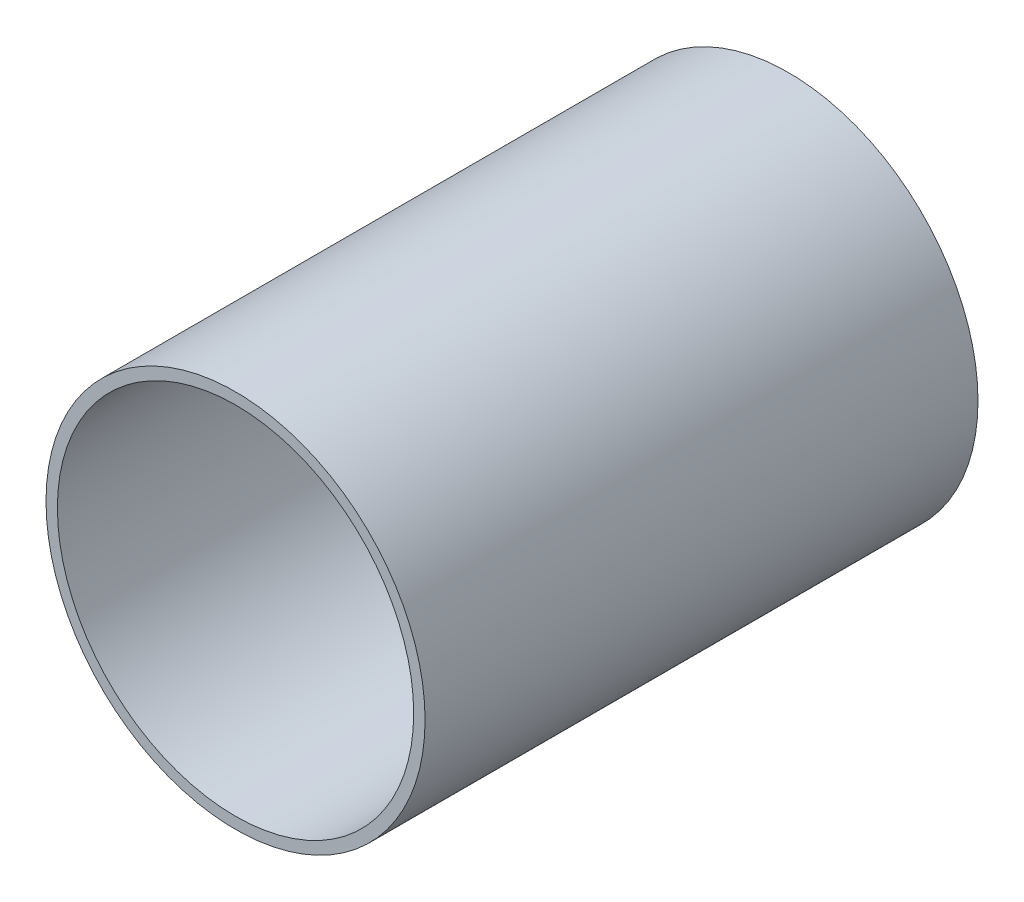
ISO-10303-21;
HEADER;
FILE_DESCRIPTION(('STEP AP214'),'2;1');
FILE_NAME('part.step','',(''),(''),'','','');
FILE_SCHEMA(('AUTOMOTIVE_DESIGN { 1 0 10303 214 1 1 1 1 }'));
ENDSEC;
DATA;
#1=APPLICATION_CONTEXT('core data for automotive mechanical design processes');
#2=APPLICATION_PROTOCOL_DEFINITION('international standard','automotive_design',2000,#1);
#3=PRODUCT_CONTEXT('',#1,'mechanical');
#4=PRODUCT('Part','Part','',(#3));
#5=PRODUCT_RELATED_PRODUCT_CATEGORY('part','',(#4));
#6=PRODUCT_DEFINITION_FORMATION('','',#4);
#7=PRODUCT_DEFINITION_CONTEXT('part definition',#1,'design');
#8=PRODUCT_DEFINITION('design','',#6,#7);
#9=PRODUCT_DEFINITION_SHAPE('','',#8);
#10=(LENGTH_UNIT() NAMED_UNIT(*) SI_UNIT(.MILLI.,.METRE.));
#11=(NAMED_UNIT(*) PLANE_ANGLE_UNIT() SI_UNIT($,.RADIAN.));
#12=(NAMED_UNIT(*) SI_UNIT($,.STERADIAN.) SOLID_ANGLE_UNIT());
#13=UNCERTAINTY_MEASURE_WITH_UNIT(LENGTH_MEASURE(1.E-05),#10,'distance_accuracy_value','');
#14=(GEOMETRIC_REPRESENTATION_CONTEXT(3) GLOBAL_UNCERTAINTY_ASSIGNED_CONTEXT((#13)) GLOBAL_UNIT_ASSIGNED_CONTEXT((#10,
#11,#12)) REPRESENTATION_CONTEXT('',''));
#15=CARTESIAN_POINT('',(0.,0.,0.));
#16=DIRECTION('',(0.,0.,1.));
#17=DIRECTION('',(1.,0.,0.));
#18=AXIS2_PLACEMENT_3D('',#15,#16,#17);
#19=CARTESIAN_POINT('',(0.,0.,194.));
#20=DIRECTION('',(0.,0.,1.));
#21=DIRECTION('',(1.,0.,0.));
#22=AXIS2_PLACEMENT_3D('',#19,#20,#21);
#23=PLANE('',#22);
#24=CARTESIAN_POINT('',(0.,0.,194.));
#25=DIRECTION('',(0.,0.,1.));
#26=DIRECTION('',(1.,0.,0.));
#27=AXIS2_PLACEMENT_3D('',#24,#25,#26);
#28=CIRCLE('',#27,66.5);
#29=CARTESIAN_POINT('',(-66.5,0.,194.));
#30=VERTEX_POINT('',#29);
#31=EDGE_CURVE('E10',#30,#30,#28,.T.);
#32=ORIENTED_EDGE('',*,*,#31,.T.);
#33=EDGE_LOOP('',(#32));
#34=FACE_BOUND('',#33,.T.);
#35=CARTESIAN_POINT('',(0.,0.,194.));
#36=DIRECTION('',(0.,0.,1.));
#37=DIRECTION('',(1.,0.,0.));
#38=AXIS2_PLACEMENT_3D('',#35,#36,#37);
#39=CIRCLE('',#38,62.5);
#40=CARTESIAN_POINT('',(-62.5,0.,194.));
#41=VERTEX_POINT('',#40);
#42=EDGE_CURVE('E357',#41,#41,#39,.T.);
#43=ORIENTED_EDGE('',*,*,#42,.F.);
#44=EDGE_LOOP('',(#43));
#45=FACE_BOUND('',#44,.T.);
#46=ADVANCED_FACE('F346',(#34,#45),#23,.T.);
#47=CARTESIAN_POINT('',(0.,0.,0.));
#48=DIRECTION('',(0.,0.,1.));
#49=DIRECTION('',(1.,0.,0.));
#50=AXIS2_PLACEMENT_3D('',#47,#48,#49);
#51=PLANE('',#50);
#52=CARTESIAN_POINT('',(0.,0.,0.));
#53=DIRECTION('',(0.,0.,1.));
#54=DIRECTION('',(1.,0.,0.));
#55=AXIS2_PLACEMENT_3D('',#52,#53,#54);
#56=CIRCLE('',#55,66.5);
#57=CARTESIAN_POINT('',(-66.5,0.,0.));
#58=VERTEX_POINT('',#57);
#59=EDGE_CURVE('E353',#58,#58,#56,.T.);
#60=ORIENTED_EDGE('',*,*,#59,.F.);
#61=EDGE_LOOP('',(#60));
#62=FACE_BOUND('',#61,.T.);
#63=CARTESIAN_POINT('',(0.,0.,0.));
#64=DIRECTION('',(0.,0.,1.));
#65=DIRECTION('',(1.,0.,0.));
#66=AXIS2_PLACEMENT_3D('',#63,#64,#65);
#67=CIRCLE('',#66,62.5);
#68=CARTESIAN_POINT('',(-62.5,0.,0.));
#69=VERTEX_POINT('',#68);
#70=EDGE_CURVE('E361',#69,#69,#67,.T.);
#71=ORIENTED_EDGE('',*,*,#70,.T.);
#72=EDGE_LOOP('',(#71));
#73=FACE_BOUND('',#72,.T.);
#74=ADVANCED_FACE('F367',(#62,#73),#51,.F.);
#75=CARTESIAN_POINT('',(0.,0.,194.));
#76=DIRECTION('',(0.,0.,-1.));
#77=DIRECTION('',(-1.,0.,0.));
#78=AXIS2_PLACEMENT_3D('',#75,#76,#77);
#79=CYLINDRICAL_SURFACE('',#78,66.5);
#80=CARTESIAN_POINT('',(-66.5,0.,194.));
#81=CARTESIAN_POINT('',(-66.5,0.,191.979166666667));
#82=CARTESIAN_POINT('',(-66.5,0.,189.958333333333));
#83=CARTESIAN_POINT('',(-66.5,0.,185.916666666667));
#84=CARTESIAN_POINT('',(-66.5,0.,183.895833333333));
#85=CARTESIAN_POINT('',(-66.5,0.,179.854166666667));
#86=CARTESIAN_POINT('',(-66.5,0.,177.833333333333));
#87=CARTESIAN_POINT('',(-66.5,0.,173.791666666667));
#88=CARTESIAN_POINT('',(-66.5,0.,171.770833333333));
#89=CARTESIAN_POINT('',(-66.5,0.,167.729166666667));
#90=CARTESIAN_POINT('',(-66.5,0.,165.708333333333));
#91=CARTESIAN_POINT('',(-66.5,0.,161.666666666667));
#92=CARTESIAN_POINT('',(-66.5,0.,159.645833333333));
#93=CARTESIAN_POINT('',(-66.5,0.,155.604166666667));
#94=CARTESIAN_POINT('',(-66.5,0.,153.583333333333));
#95=CARTESIAN_POINT('',(-66.5,0.,149.541666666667));
#96=CARTESIAN_POINT('',(-66.5,0.,147.520833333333));
#97=CARTESIAN_POINT('',(-66.5,0.,143.479166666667));
#98=CARTESIAN_POINT('',(-66.5,0.,141.458333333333));
#99=CARTESIAN_POINT('',(-66.5,0.,137.416666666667));
#100=CARTESIAN_POINT('',(-66.5,0.,135.395833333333));
#101=CARTESIAN_POINT('',(-66.5,0.,131.354166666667));
#102=CARTESIAN_POINT('',(-66.5,0.,129.333333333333));
#103=CARTESIAN_POINT('',(-66.5,0.,125.291666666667));
#104=CARTESIAN_POINT('',(-66.5,0.,123.270833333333));
#105=CARTESIAN_POINT('',(-66.5,0.,119.229166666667));
#106=CARTESIAN_POINT('',(-66.5,0.,117.208333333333));
#107=CARTESIAN_POINT('',(-66.5,0.,113.166666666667));
#108=CARTESIAN_POINT('',(-66.5,0.,111.145833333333));
#109=CARTESIAN_POINT('',(-66.5,0.,107.104166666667));
#110=CARTESIAN_POINT('',(-66.5,0.,105.083333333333));
#111=CARTESIAN_POINT('',(-66.5,0.,101.041666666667));
#112=CARTESIAN_POINT('',(-66.5,0.,99.0208333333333));
#113=CARTESIAN_POINT('',(-66.5,0.,94.9791666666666));
#114=CARTESIAN_POINT('',(-66.5,0.,92.9583333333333));
#115=CARTESIAN_POINT('',(-66.5,0.,88.9166666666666));
#116=CARTESIAN_POINT('',(-66.5,0.,86.8958333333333));
#117=CARTESIAN_POINT('',(-66.5,0.,82.8541666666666));
#118=CARTESIAN_POINT('',(-66.5,0.,80.8333333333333));
#119=CARTESIAN_POINT('',(-66.5,0.,76.7916666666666));
#120=CARTESIAN_POINT('',(-66.5,0.,74.7708333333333));
#121=CARTESIAN_POINT('',(-66.5,0.,70.7291666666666));
#122=CARTESIAN_POINT('',(-66.5,0.,68.7083333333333));
#123=CARTESIAN_POINT('',(-66.5,0.,64.6666666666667));
#124=CARTESIAN_POINT('',(-66.5,0.,62.6458333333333));
#125=CARTESIAN_POINT('',(-66.5,0.,58.6041666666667));
#126=CARTESIAN_POINT('',(-66.5,0.,56.5833333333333));
#127=CARTESIAN_POINT('',(-66.5,0.,52.5416666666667));
#128=CARTESIAN_POINT('',(-66.5,0.,50.5208333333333));
#129=CARTESIAN_POINT('',(-66.5,0.,46.4791666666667));
#130=CARTESIAN_POINT('',(-66.5,0.,44.4583333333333));
#131=CARTESIAN_POINT('',(-66.5,0.,40.4166666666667));
#132=CARTESIAN_POINT('',(-66.5,0.,38.3958333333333));
#133=CARTESIAN_POINT('',(-66.5,0.,34.3541666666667));
#134=CARTESIAN_POINT('',(-66.5,0.,32.3333333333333));
#135=CARTESIAN_POINT('',(-66.5,0.,28.2916666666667));
#136=CARTESIAN_POINT('',(-66.5,0.,26.2708333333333));
#137=CARTESIAN_POINT('',(-66.5,0.,22.2291666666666));
#138=CARTESIAN_POINT('',(-66.5,0.,20.2083333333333));
#139=CARTESIAN_POINT('',(-66.5,0.,16.1666666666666));
#140=CARTESIAN_POINT('',(-66.5,0.,14.1458333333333));
#141=CARTESIAN_POINT('',(-66.5,0.,10.1041666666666));
#142=CARTESIAN_POINT('',(-66.5,0.,8.0833333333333));
#143=CARTESIAN_POINT('',(-66.5,0.,4.04166666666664));
#144=CARTESIAN_POINT('',(-66.5,0.,2.02083333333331));
#145=CARTESIAN_POINT('',(-66.5,0.,0.));
#146=B_SPLINE_CURVE_WITH_KNOTS('',3,(#80,#81,#82,#83,#84,#85,#86,#87,#88,#89,#90,#91,#92,#93,
#94,#95,#96,#97,#98,#99,#100,#101,#102,#103,#104,#105,#106,#107,#108,#109,#110,#111,#112,#113,
#114,#115,#116,#117,#118,#119,#120,#121,#122,#123,#124,#125,#126,#127,#128,#129,#130,#131,#132,
#133,#134,#135,#136,#137,#138,#139,#140,#141,#142,#143,#144,#145),.UNSPECIFIED.,.F.,.F.,(4,2,2,
2,2,2,2,2,2,2,2,2,2,2,2,2,2,2,2,2,2,2,2,2,2,2,2,2,2,2,2,2,4),(0.,6.06250000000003,12.125,
18.1875,24.25,30.3125,36.375,42.4375,48.5,54.5625,60.625,66.6875,72.75,78.8125,84.875,90.9375,
97.,103.0625,109.125,115.1875,121.25,127.3125,133.375,139.4375,145.5,151.5625,157.625,163.6875,
169.75,175.8125,181.875,187.9375,194.),.UNSPECIFIED.);
#147=EDGE_CURVE('BSEAM348',#30,#58,#146,.T.);
#148=ORIENTED_EDGE('',*,*,#31,.F.);
#149=ORIENTED_EDGE('',*,*,#59,.T.);
#150=ORIENTED_EDGE('',*,*,#147,.T.);
#151=ORIENTED_EDGE('',*,*,#147,.F.);
#152=EDGE_LOOP('',(#148,#150,#149,#151));
#153=FACE_BOUND('',#152,.T.);
#154=ADVANCED_FACE('F348',(#153),#79,.T.);
#155=CARTESIAN_POINT('',(0.,0.,194.));
#156=DIRECTION('',(0.,0.,-1.));
#157=DIRECTION('',(-1.,0.,0.));
#158=AXIS2_PLACEMENT_3D('',#155,#156,#157);
#159=CYLINDRICAL_SURFACE('',#158,62.5);
#160=CARTESIAN_POINT('',(-62.5,0.,194.));
#161=CARTESIAN_POINT('',(-62.5,0.,191.979166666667));
#162=CARTESIAN_POINT('',(-62.5,0.,189.958333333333));
#163=CARTESIAN_POINT('',(-62.5,0.,185.916666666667));
#164=CARTESIAN_POINT('',(-62.5,0.,183.895833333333));
#165=CARTESIAN_POINT('',(-62.5,0.,179.854166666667));
#166=CARTESIAN_POINT('',(-62.5,0.,177.833333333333));
#167=CARTESIAN_POINT('',(-62.5,0.,173.791666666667));
#168=CARTESIAN_POINT('',(-62.5,0.,171.770833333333));
#169=CARTESIAN_POINT('',(-62.5,0.,167.729166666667));
#170=CARTESIAN_POINT('',(-62.5,0.,165.708333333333));
#171=CARTESIAN_POINT('',(-62.5,0.,161.666666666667));
#172=CARTESIAN_POINT('',(-62.5,0.,159.645833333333));
#173=CARTESIAN_POINT('',(-62.5,0.,155.604166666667));
#174=CARTESIAN_POINT('',(-62.5,0.,153.583333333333));
#175=CARTESIAN_POINT('',(-62.5,0.,149.541666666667));
#176=CARTESIAN_POINT('',(-62.5,0.,147.520833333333));
#177=CARTESIAN_POINT('',(-62.5,0.,143.479166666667));
#178=CARTESIAN_POINT('',(-62.5,0.,141.458333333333));
#179=CARTESIAN_POINT('',(-62.5,0.,137.416666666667));
#180=CARTESIAN_POINT('',(-62.5,0.,135.395833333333));
#181=CARTESIAN_POINT('',(-62.5,0.,131.354166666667));
#182=CARTESIAN_POINT('',(-62.5,0.,129.333333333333));
#183=CARTESIAN_POINT('',(-62.5,0.,125.291666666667));
#184=CARTESIAN_POINT('',(-62.5,0.,123.270833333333));
#185=CARTESIAN_POINT('',(-62.5,0.,119.229166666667));
#186=CARTESIAN_POINT('',(-62.5,0.,117.208333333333));
#187=CARTESIAN_POINT('',(-62.5,0.,113.166666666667));
#188=CARTESIAN_POINT('',(-62.5,0.,111.145833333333));
#189=CARTESIAN_POINT('',(-62.5,0.,107.104166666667));
#190=CARTESIAN_POINT('',(-62.5,0.,105.083333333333));
#191=CARTESIAN_POINT('',(-62.5,0.,101.041666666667));
#192=CARTESIAN_POINT('',(-62.5,0.,99.0208333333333));
#193=CARTESIAN_POINT('',(-62.5,0.,94.9791666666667));
#194=CARTESIAN_POINT('',(-62.5,0.,92.9583333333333));
#195=CARTESIAN_POINT('',(-62.5,0.,88.9166666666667));
#196=CARTESIAN_POINT('',(-62.5,0.,86.8958333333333));
#197=CARTESIAN_POINT('',(-62.5,0.,82.8541666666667));
#198=CARTESIAN_POINT('',(-62.5,0.,80.8333333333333));
#199=CARTESIAN_POINT('',(-62.5,0.,76.7916666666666));
#200=CARTESIAN_POINT('',(-62.5,0.,74.7708333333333));
#201=CARTESIAN_POINT('',(-62.5,0.,70.7291666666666));
#202=CARTESIAN_POINT('',(-62.5,0.,68.7083333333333));
#203=CARTESIAN_POINT('',(-62.5,0.,64.6666666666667));
#204=CARTESIAN_POINT('',(-62.5,0.,62.6458333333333));
#205=CARTESIAN_POINT('',(-62.5,0.,58.6041666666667));
#206=CARTESIAN_POINT('',(-62.5,0.,56.5833333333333));
#207=CARTESIAN_POINT('',(-62.5,0.,52.5416666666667));
#208=CARTESIAN_POINT('',(-62.5,0.,50.5208333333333));
#209=CARTESIAN_POINT('',(-62.5,0.,46.4791666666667));
#210=CARTESIAN_POINT('',(-62.5,0.,44.4583333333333));
#211=CARTESIAN_POINT('',(-62.5,0.,40.4166666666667));
#212=CARTESIAN_POINT('',(-62.5,0.,38.3958333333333));
#213=CARTESIAN_POINT('',(-62.5,0.,34.3541666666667));
#214=CARTESIAN_POINT('',(-62.5,0.,32.3333333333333));
#215=CARTESIAN_POINT('',(-62.5,0.,28.2916666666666));
#216=CARTESIAN_POINT('',(-62.5,0.,26.2708333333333));
#217=CARTESIAN_POINT('',(-62.5,0.,22.2291666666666));
#218=CARTESIAN_POINT('',(-62.5,0.,20.2083333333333));
#219=CARTESIAN_POINT('',(-62.5,0.,16.1666666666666));
#220=CARTESIAN_POINT('',(-62.5,0.,14.1458333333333));
#221=CARTESIAN_POINT('',(-62.5,0.,10.1041666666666));
#222=CARTESIAN_POINT('',(-62.5,0.,8.0833333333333));
#223=CARTESIAN_POINT('',(-62.5,0.,4.04166666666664));
#224=CARTESIAN_POINT('',(-62.5,0.,2.02083333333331));
#225=CARTESIAN_POINT('',(-62.5,0.,0.));
#226=B_SPLINE_CURVE_WITH_KNOTS('',3,(#160,#161,#162,#163,#164,#165,#166,#167,#168,#169,#170,
#171,#172,#173,#174,#175,#176,#177,#178,#179,#180,#181,#182,#183,#184,#185,#186,#187,#188,#189,
#190,#191,#192,#193,#194,#195,#196,#197,#198,#199,#200,#201,#202,#203,#204,#205,#206,#207,#208,
#209,#210,#211,#212,#213,#214,#215,#216,#217,#218,#219,#220,#221,#222,#223,#224,#225),
.UNSPECIFIED.,.F.,.F.,(4,2,2,2,2,2,2,2,2,2,2,2,2,2,2,2,2,2,2,2,2,2,2,2,2,2,2,2,2,2,2,2,4),(0.,
6.0625,12.125,18.1875,24.25,30.3125,36.375,42.4375,48.5,54.5625,60.625,66.6875,72.75,78.8125,
84.875,90.9375,97.,103.0625,109.125,115.1875,121.25,127.3125,133.375,139.4375,145.5,151.5625,
157.625,163.6875,169.75,175.8125,181.875,187.9375,194.),.UNSPECIFIED.);
#227=EDGE_CURVE('BSEAM369',#41,#69,#226,.T.);
#228=ORIENTED_EDGE('',*,*,#42,.T.);
#229=ORIENTED_EDGE('',*,*,#70,.F.);
#230=ORIENTED_EDGE('',*,*,#227,.T.);
#231=ORIENTED_EDGE('',*,*,#227,.F.);
#232=EDGE_LOOP('',(#228,#230,#229,#231));
#233=FACE_BOUND('',#232,.T.);
#234=ADVANCED_FACE('F369',(#233),#159,.F.);
#235=CLOSED_SHELL('',(#46,#74,#154,#234));
#236=MANIFOLD_SOLID_BREP('B2',#235);
#237=ADVANCED_BREP_SHAPE_REPRESENTATION('',(#18,#236),#14);
#238=SHAPE_DEFINITION_REPRESENTATION(#9,#237);
ENDSEC;
END-ISO-10303-21;
